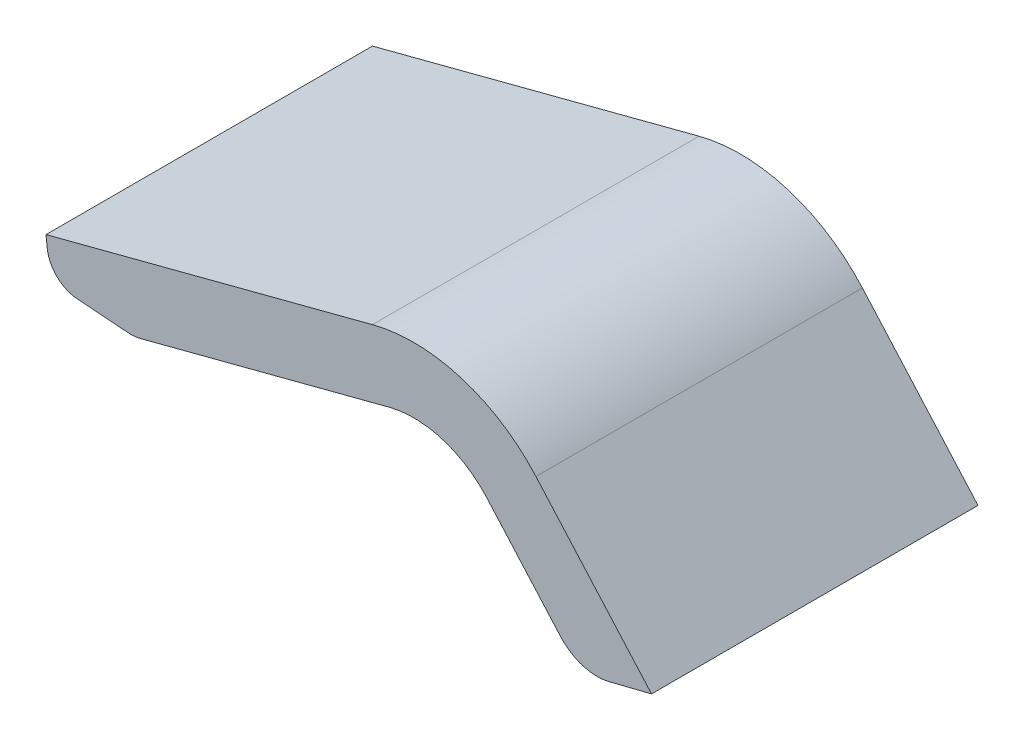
ISO-10303-21;
HEADER;
FILE_DESCRIPTION(('STEP AP214'),'2;1');
FILE_NAME('part.step','',(''),(''),'','','');
FILE_SCHEMA(('AUTOMOTIVE_DESIGN { 1 0 10303 214 1 1 1 1 }'));
ENDSEC;
DATA;
#1=APPLICATION_CONTEXT('core data for automotive mechanical design processes');
#2=APPLICATION_PROTOCOL_DEFINITION('international standard','automotive_design',2000,#1);
#3=PRODUCT_CONTEXT('',#1,'mechanical');
#4=PRODUCT('Part','Part','',(#3));
#5=PRODUCT_RELATED_PRODUCT_CATEGORY('part','',(#4));
#6=PRODUCT_DEFINITION_FORMATION('','',#4);
#7=PRODUCT_DEFINITION_CONTEXT('part definition',#1,'design');
#8=PRODUCT_DEFINITION('design','',#6,#7);
#9=PRODUCT_DEFINITION_SHAPE('','',#8);
#10=(LENGTH_UNIT() NAMED_UNIT(*) SI_UNIT(.MILLI.,.METRE.));
#11=(NAMED_UNIT(*) PLANE_ANGLE_UNIT() SI_UNIT($,.RADIAN.));
#12=(NAMED_UNIT(*) SI_UNIT($,.STERADIAN.) SOLID_ANGLE_UNIT());
#13=UNCERTAINTY_MEASURE_WITH_UNIT(LENGTH_MEASURE(1.E-05),#10,'distance_accuracy_value','');
#14=(GEOMETRIC_REPRESENTATION_CONTEXT(3) GLOBAL_UNCERTAINTY_ASSIGNED_CONTEXT((#13)) GLOBAL_UNIT_ASSIGNED_CONTEXT((#10,
#11,#12)) REPRESENTATION_CONTEXT('',''));
#15=CARTESIAN_POINT('',(0.,0.,0.));
#16=DIRECTION('',(0.,0.,1.));
#17=DIRECTION('',(1.,0.,0.));
#18=AXIS2_PLACEMENT_3D('',#15,#16,#17);
#19=CARTESIAN_POINT('',(-13.3347137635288,0.567654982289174,20.));
#20=DIRECTION('',(0.,0.,-1.));
#21=DIRECTION('',(-1.,0.,0.));
#22=AXIS2_PLACEMENT_3D('',#19,#20,#21);
#23=CYLINDRICAL_SURFACE('',#22,2.);
#24=CARTESIAN_POINT('',(-13.3347137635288,0.567654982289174,0.));
#25=DIRECTION('',(0.,0.,1.));
#26=DIRECTION('',(1.,0.,0.));
#27=AXIS2_PLACEMENT_3D('',#24,#25,#26);
#28=CIRCLE('',#27,2.);
#29=CARTESIAN_POINT('',(-12.8296538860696,-1.36752318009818,0.));
#30=VERTEX_POINT('',#29);
#31=CARTESIAN_POINT('',(-13.4835254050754,-1.42680110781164,0.));
#32=VERTEX_POINT('',#31);
#33=EDGE_CURVE('E143',#30,#32,#28,.F.);
#34=ORIENTED_EDGE('',*,*,#33,.F.);
#35=DIRECTION('',(0.,0.,-1.));
#36=VECTOR('',#35,1.);
#37=CARTESIAN_POINT('',(-12.8296538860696,-1.36752318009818,20.));
#38=LINE('',#37,#36);
#39=CARTESIAN_POINT('',(-12.8296538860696,-1.36752318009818,20.));
#40=VERTEX_POINT('',#39);
#41=EDGE_CURVE('E13',#40,#30,#38,.T.);
#42=ORIENTED_EDGE('',*,*,#41,.F.);
#43=CARTESIAN_POINT('',(-13.3347137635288,0.567654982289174,20.));
#44=DIRECTION('',(0.,0.,1.));
#45=DIRECTION('',(1.,0.,0.));
#46=AXIS2_PLACEMENT_3D('',#43,#44,#45);
#47=CIRCLE('',#46,2.);
#48=CARTESIAN_POINT('',(-13.4835254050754,-1.42680110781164,20.));
#49=VERTEX_POINT('',#48);
#50=EDGE_CURVE('E179',#40,#49,#47,.F.);
#51=ORIENTED_EDGE('',*,*,#50,.T.);
#52=DIRECTION('',(0.,0.,-1.));
#53=VECTOR('',#52,1.);
#54=CARTESIAN_POINT('',(-13.4835254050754,-1.42680110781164,20.));
#55=LINE('',#54,#53);
#56=EDGE_CURVE('E148',#49,#32,#55,.T.);
#57=ORIENTED_EDGE('',*,*,#56,.T.);
#58=EDGE_LOOP('',(#34,#42,#51,#57));
#59=FACE_BOUND('',#58,.T.);
#60=ADVANCED_FACE('F41',(#59),#23,.T.);
#61=CARTESIAN_POINT('',(-6.83704279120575,0.1964813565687,20.));
#62=DIRECTION('',(-0.252529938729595,0.967589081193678,0.));
#63=DIRECTION('',(-0.967589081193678,-0.252529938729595,0.));
#64=AXIS2_PLACEMENT_3D('',#61,#62,#63);
#65=PLANE('',#64);
#66=DIRECTION('',(0.967589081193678,0.252529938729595,0.));
#67=VECTOR('',#66,1.);
#68=CARTESIAN_POINT('',(-6.83704279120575,0.1964813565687,0.));
#69=LINE('',#68,#67);
#70=CARTESIAN_POINT('',(2.43283974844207,2.61581712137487,0.));
#71=VERTEX_POINT('',#70);
#72=EDGE_CURVE('E133',#30,#71,#69,.T.);
#73=ORIENTED_EDGE('',*,*,#72,.T.);
#74=DIRECTION('',(0.,0.,-1.));
#75=VECTOR('',#74,1.);
#76=CARTESIAN_POINT('',(2.43283974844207,2.61581712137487,20.));
#77=LINE('',#76,#75);
#78=CARTESIAN_POINT('',(2.43283974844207,2.61581712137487,20.));
#79=VERTEX_POINT('',#78);
#80=EDGE_CURVE('E48',#79,#71,#77,.T.);
#81=ORIENTED_EDGE('',*,*,#80,.F.);
#82=DIRECTION('',(0.967589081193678,0.252529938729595,0.));
#83=VECTOR('',#82,1.);
#84=CARTESIAN_POINT('',(-6.83704279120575,0.1964813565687,20.));
#85=LINE('',#84,#83);
#86=EDGE_CURVE('E135',#40,#79,#85,.T.);
#87=ORIENTED_EDGE('',*,*,#86,.F.);
#88=ORIENTED_EDGE('',*,*,#41,.T.);
#89=EDGE_LOOP('',(#73,#81,#87,#88));
#90=FACE_BOUND('',#89,.T.);
#91=ADVANCED_FACE('F131',(#90),#65,.F.);
#92=CARTESIAN_POINT('',(3.94801938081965,-3.1897173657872,20.));
#93=DIRECTION('',(0.,0.,-1.));
#94=DIRECTION('',(-1.,0.,0.));
#95=AXIS2_PLACEMENT_3D('',#92,#93,#94);
#96=CYLINDRICAL_SURFACE('',#95,6.00000000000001);
#97=CARTESIAN_POINT('',(3.94801938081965,-3.1897173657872,0.));
#98=DIRECTION('',(0.,0.,1.));
#99=DIRECTION('',(1.,0.,0.));
#100=AXIS2_PLACEMENT_3D('',#97,#98,#99);
#101=CIRCLE('',#100,6.00000000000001);
#102=CARTESIAN_POINT('',(8.44002044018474,0.787961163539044,0.));
#103=VERTEX_POINT('',#102);
#104=EDGE_CURVE('E146',#103,#71,#101,.T.);
#105=ORIENTED_EDGE('',*,*,#104,.F.);
#106=DIRECTION('',(0.,0.,-1.));
#107=VECTOR('',#106,1.);
#108=CARTESIAN_POINT('',(8.44002044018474,0.787961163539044,20.));
#109=LINE('',#108,#107);
#110=CARTESIAN_POINT('',(8.44002044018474,0.787961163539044,20.));
#111=VERTEX_POINT('',#110);
#112=EDGE_CURVE('E222',#111,#103,#109,.T.);
#113=ORIENTED_EDGE('',*,*,#112,.F.);
#114=CARTESIAN_POINT('',(3.94801938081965,-3.1897173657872,20.));
#115=DIRECTION('',(0.,0.,1.));
#116=DIRECTION('',(1.,0.,0.));
#117=AXIS2_PLACEMENT_3D('',#114,#115,#116);
#118=CIRCLE('',#117,6.00000000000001);
#119=EDGE_CURVE('E182',#111,#79,#118,.T.);
#120=ORIENTED_EDGE('',*,*,#119,.T.);
#121=ORIENTED_EDGE('',*,*,#80,.T.);
#122=EDGE_LOOP('',(#105,#113,#120,#121));
#123=FACE_BOUND('',#122,.T.);
#124=ADVANCED_FACE('F224',(#123),#96,.F.);
#125=CARTESIAN_POINT('',(19.7707149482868,-12.0078169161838,20.));
#126=DIRECTION('',(0.748666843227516,0.662946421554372,0.));
#127=DIRECTION('',(-0.662946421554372,0.748666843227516,0.));
#128=AXIS2_PLACEMENT_3D('',#125,#126,#127);
#129=PLANE('',#128);
#130=DIRECTION('',(0.662946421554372,-0.748666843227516,0.));
#131=VECTOR('',#130,1.);
#132=CARTESIAN_POINT('',(19.7707149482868,-12.0078169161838,0.));
#133=LINE('',#132,#131);
#134=CARTESIAN_POINT('',(12.9326564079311,-4.28558245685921,0.));
#135=VERTEX_POINT('',#134);
#136=EDGE_CURVE('E153',#103,#135,#133,.T.);
#137=ORIENTED_EDGE('',*,*,#136,.T.);
#138=DIRECTION('',(0.,0.,-1.));
#139=VECTOR('',#138,1.);
#140=CARTESIAN_POINT('',(12.9326564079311,-4.28558245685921,20.));
#141=LINE('',#140,#139);
#142=CARTESIAN_POINT('',(12.9326564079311,-4.28558245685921,20.));
#143=VERTEX_POINT('',#142);
#144=EDGE_CURVE('E220',#143,#135,#141,.T.);
#145=ORIENTED_EDGE('',*,*,#144,.F.);
#146=DIRECTION('',(0.662946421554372,-0.748666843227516,0.));
#147=VECTOR('',#146,1.);
#148=CARTESIAN_POINT('',(19.7707149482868,-12.0078169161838,20.));
#149=LINE('',#148,#147);
#150=EDGE_CURVE('E185',#111,#143,#149,.T.);
#151=ORIENTED_EDGE('',*,*,#150,.F.);
#152=ORIENTED_EDGE('',*,*,#112,.T.);
#153=EDGE_LOOP('',(#137,#145,#151,#152));
#154=FACE_BOUND('',#153,.T.);
#155=ADVANCED_FACE('F232',(#154),#129,.F.);
#156=CARTESIAN_POINT('',(15.1786569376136,-2.2967431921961,20.));
#157=DIRECTION('',(0.,0.,-1.));
#158=DIRECTION('',(-1.,0.,0.));
#159=AXIS2_PLACEMENT_3D('',#156,#157,#158);
#160=CYLINDRICAL_SURFACE('',#159,3.);
#161=CARTESIAN_POINT('',(15.1786569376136,-2.2967431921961,0.));
#162=DIRECTION('',(0.,0.,1.));
#163=DIRECTION('',(1.,0.,0.));
#164=AXIS2_PLACEMENT_3D('',#161,#162,#163);
#165=CIRCLE('',#164,3.);
#166=CARTESIAN_POINT('',(15.9036492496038,-5.20782308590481,0.));
#167=VERTEX_POINT('',#166);
#168=EDGE_CURVE('E156',#167,#135,#165,.F.);
#169=ORIENTED_EDGE('',*,*,#168,.F.);
#170=DIRECTION('',(0.,0.,-1.));
#171=VECTOR('',#170,1.);
#172=CARTESIAN_POINT('',(15.9036492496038,-5.20782308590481,20.));
#173=LINE('',#172,#171);
#174=CARTESIAN_POINT('',(15.9036492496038,-5.20782308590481,20.));
#175=VERTEX_POINT('',#174);
#176=EDGE_CURVE('E218',#175,#167,#173,.T.);
#177=ORIENTED_EDGE('',*,*,#176,.F.);
#178=CARTESIAN_POINT('',(15.1786569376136,-2.2967431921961,20.));
#179=DIRECTION('',(0.,0.,1.));
#180=DIRECTION('',(1.,0.,0.));
#181=AXIS2_PLACEMENT_3D('',#178,#179,#180);
#182=CIRCLE('',#181,3.);
#183=EDGE_CURVE('E187',#175,#143,#182,.F.);
#184=ORIENTED_EDGE('',*,*,#183,.T.);
#185=ORIENTED_EDGE('',*,*,#144,.T.);
#186=EDGE_LOOP('',(#169,#177,#184,#185));
#187=FACE_BOUND('',#186,.T.);
#188=ADVANCED_FACE('F235',(#187),#160,.T.);
#189=CARTESIAN_POINT('',(-3.91493636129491,-10.1435592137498,20.));
#190=DIRECTION('',(0.241664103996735,-0.970359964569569,0.));
#191=DIRECTION('',(0.970359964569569,0.241664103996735,0.));
#192=AXIS2_PLACEMENT_3D('',#189,#190,#191);
#193=PLANE('',#192);
#194=DIRECTION('',(-0.970359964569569,-0.241664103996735,0.));
#195=VECTOR('',#194,1.);
#196=CARTESIAN_POINT('',(-3.91493636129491,-10.1435592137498,0.));
#197=LINE('',#196,#195);
#198=CARTESIAN_POINT('',(18.5160243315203,-4.55722196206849,0.));
#199=VERTEX_POINT('',#198);
#200=EDGE_CURVE('E159',#199,#167,#197,.T.);
#201=ORIENTED_EDGE('',*,*,#200,.F.);
#202=DIRECTION('',(0.,0.,-1.));
#203=VECTOR('',#202,1.);
#204=CARTESIAN_POINT('',(18.5160243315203,-4.55722196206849,20.));
#205=LINE('',#204,#203);
#206=CARTESIAN_POINT('',(18.5160243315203,-4.55722196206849,20.));
#207=VERTEX_POINT('',#206);
#208=EDGE_CURVE('E216',#207,#199,#205,.T.);
#209=ORIENTED_EDGE('',*,*,#208,.F.);
#210=DIRECTION('',(-0.970359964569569,-0.241664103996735,0.));
#211=VECTOR('',#210,1.);
#212=CARTESIAN_POINT('',(-3.91493636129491,-10.1435592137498,20.));
#213=LINE('',#212,#211);
#214=EDGE_CURVE('E190',#207,#175,#213,.T.);
#215=ORIENTED_EDGE('',*,*,#214,.T.);
#216=ORIENTED_EDGE('',*,*,#176,.T.);
#217=EDGE_LOOP('',(#201,#209,#215,#216));
#218=FACE_BOUND('',#217,.T.);
#219=ADVANCED_FACE('F238',(#218),#193,.T.);
#220=CARTESIAN_POINT('',(22.7653823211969,-9.35603122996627,20.));
#221=DIRECTION('',(0.748666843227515,0.662946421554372,0.));
#222=DIRECTION('',(-0.662946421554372,0.748666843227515,0.));
#223=AXIS2_PLACEMENT_3D('',#220,#221,#222);
#224=PLANE('',#223);
#225=DIRECTION('',(0.662946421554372,-0.748666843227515,0.));
#226=VECTOR('',#225,1.);
#227=CARTESIAN_POINT('',(22.7653823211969,-9.35603122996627,0.));
#228=LINE('',#227,#226);
#229=CARTESIAN_POINT('',(11.4346878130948,3.43974684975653,0.));
#230=VERTEX_POINT('',#229);
#231=EDGE_CURVE('E162',#230,#199,#228,.T.);
#232=ORIENTED_EDGE('',*,*,#231,.F.);
#233=DIRECTION('',(0.,0.,-1.));
#234=VECTOR('',#233,1.);
#235=CARTESIAN_POINT('',(11.4346878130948,3.43974684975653,20.));
#236=LINE('',#235,#234);
#237=CARTESIAN_POINT('',(11.4346878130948,3.43974684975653,20.));
#238=VERTEX_POINT('',#237);
#239=EDGE_CURVE('E214',#238,#230,#236,.T.);
#240=ORIENTED_EDGE('',*,*,#239,.F.);
#241=DIRECTION('',(0.662946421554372,-0.748666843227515,0.));
#242=VECTOR('',#241,1.);
#243=CARTESIAN_POINT('',(22.7653823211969,-9.35603122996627,20.));
#244=LINE('',#243,#242);
#245=EDGE_CURVE('E193',#238,#207,#244,.T.);
#246=ORIENTED_EDGE('',*,*,#245,.T.);
#247=ORIENTED_EDGE('',*,*,#208,.T.);
#248=EDGE_LOOP('',(#232,#240,#246,#247));
#249=FACE_BOUND('',#248,.T.);
#250=ADVANCED_FACE('F242',(#249),#224,.T.);
#251=CARTESIAN_POINT('',(3.94801938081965,-3.1897173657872,20.));
#252=DIRECTION('',(0.,0.,-1.));
#253=DIRECTION('',(-1.,0.,0.));
#254=AXIS2_PLACEMENT_3D('',#251,#252,#253);
#255=CYLINDRICAL_SURFACE('',#254,10.);
#256=CARTESIAN_POINT('',(3.94801938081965,-3.1897173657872,0.));
#257=DIRECTION('',(0.,0.,1.));
#258=DIRECTION('',(1.,0.,0.));
#259=AXIS2_PLACEMENT_3D('',#256,#257,#258);
#260=CIRCLE('',#259,10.);
#261=CARTESIAN_POINT('',(1.42271999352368,6.48617344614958,0.));
#262=VERTEX_POINT('',#261);
#263=EDGE_CURVE('E165',#230,#262,#260,.T.);
#264=ORIENTED_EDGE('',*,*,#263,.T.);
#265=DIRECTION('',(0.,0.,-1.));
#266=VECTOR('',#265,1.);
#267=CARTESIAN_POINT('',(1.42271999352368,6.48617344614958,20.));
#268=LINE('',#267,#266);
#269=CARTESIAN_POINT('',(1.42271999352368,6.48617344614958,20.));
#270=VERTEX_POINT('',#269);
#271=EDGE_CURVE('E212',#270,#262,#268,.T.);
#272=ORIENTED_EDGE('',*,*,#271,.F.);
#273=CARTESIAN_POINT('',(3.94801938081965,-3.1897173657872,20.));
#274=DIRECTION('',(0.,0.,1.));
#275=DIRECTION('',(1.,0.,0.));
#276=AXIS2_PLACEMENT_3D('',#273,#274,#275);
#277=CIRCLE('',#276,10.);
#278=EDGE_CURVE('E196',#238,#270,#277,.T.);
#279=ORIENTED_EDGE('',*,*,#278,.F.);
#280=ORIENTED_EDGE('',*,*,#239,.T.);
#281=EDGE_LOOP('',(#264,#272,#279,#280));
#282=FACE_BOUND('',#281,.T.);
#283=ADVANCED_FACE('F247',(#282),#255,.T.);
#284=CARTESIAN_POINT('',(-7.84716254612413,4.06683768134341,20.));
#285=DIRECTION('',(-0.252529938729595,0.967589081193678,0.));
#286=DIRECTION('',(-0.967589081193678,-0.252529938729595,0.));
#287=AXIS2_PLACEMENT_3D('',#284,#285,#286);
#288=PLANE('',#287);
#289=DIRECTION('',(0.967589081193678,0.252529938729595,0.));
#290=VECTOR('',#289,1.);
#291=CARTESIAN_POINT('',(-7.84716254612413,4.06683768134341,0.));
#292=LINE('',#291,#290);
#293=CARTESIAN_POINT('',(-18.5772800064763,1.26639691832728,0.));
#294=VERTEX_POINT('',#293);
#295=EDGE_CURVE('E168',#294,#262,#292,.T.);
#296=ORIENTED_EDGE('',*,*,#295,.F.);
#297=DIRECTION('',(0.,0.,-1.));
#298=VECTOR('',#297,1.);
#299=CARTESIAN_POINT('',(-18.5772800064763,1.26639691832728,20.));
#300=LINE('',#299,#298);
#301=CARTESIAN_POINT('',(-18.5772800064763,1.26639691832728,20.));
#302=VERTEX_POINT('',#301);
#303=EDGE_CURVE('E210',#302,#294,#300,.T.);
#304=ORIENTED_EDGE('',*,*,#303,.F.);
#305=DIRECTION('',(0.967589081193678,0.252529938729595,0.));
#306=VECTOR('',#305,1.);
#307=CARTESIAN_POINT('',(-7.84716254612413,4.06683768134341,20.));
#308=LINE('',#307,#306);
#309=EDGE_CURVE('E198',#302,#270,#308,.T.);
#310=ORIENTED_EDGE('',*,*,#309,.T.);
#311=ORIENTED_EDGE('',*,*,#271,.T.);
#312=EDGE_LOOP('',(#296,#304,#310,#311));
#313=FACE_BOUND('',#312,.T.);
#314=ADVANCED_FACE('F253',(#313),#288,.T.);
#315=CARTESIAN_POINT('',(-15.06698153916,-30.597029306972,20.));
#316=DIRECTION('',(0.993986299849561,0.109504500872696,0.));
#317=DIRECTION('',(-0.109504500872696,0.993986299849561,0.));
#318=AXIS2_PLACEMENT_3D('',#315,#316,#317);
#319=PLANE('',#318);
#320=DIRECTION('',(0.109504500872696,-0.993986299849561,0.));
#321=VECTOR('',#320,1.);
#322=CARTESIAN_POINT('',(-15.06698153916,-30.597029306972,0.));
#323=LINE('',#322,#321);
#324=CARTESIAN_POINT('',(-18.5023101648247,0.58588611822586,0.));
#325=VERTEX_POINT('',#324);
#326=EDGE_CURVE('E171',#294,#325,#323,.T.);
#327=ORIENTED_EDGE('',*,*,#326,.T.);
#328=DIRECTION('',(0.,0.,-1.));
#329=VECTOR('',#328,1.);
#330=CARTESIAN_POINT('',(-18.5023101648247,0.58588611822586,20.));
#331=LINE('',#330,#329);
#332=CARTESIAN_POINT('',(-18.5023101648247,0.58588611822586,20.));
#333=VERTEX_POINT('',#332);
#334=EDGE_CURVE('E208',#333,#325,#331,.T.);
#335=ORIENTED_EDGE('',*,*,#334,.F.);
#336=DIRECTION('',(0.109504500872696,-0.993986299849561,0.));
#337=VECTOR('',#336,1.);
#338=CARTESIAN_POINT('',(-15.06698153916,-30.597029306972,20.));
#339=LINE('',#338,#337);
#340=EDGE_CURVE('E201',#302,#333,#339,.T.);
#341=ORIENTED_EDGE('',*,*,#340,.F.);
#342=ORIENTED_EDGE('',*,*,#303,.T.);
#343=EDGE_LOOP('',(#327,#335,#341,#342));
#344=FACE_BOUND('',#343,.T.);
#345=ADVANCED_FACE('F256',(#344),#319,.F.);
#346=CARTESIAN_POINT('',(-16.5143375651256,0.804895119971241,20.));
#347=DIRECTION('',(0.,0.,-1.));
#348=DIRECTION('',(-1.,0.,0.));
#349=AXIS2_PLACEMENT_3D('',#346,#347,#348);
#350=CYLINDRICAL_SURFACE('',#349,2.);
#351=CARTESIAN_POINT('',(-16.5143375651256,0.804895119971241,0.));
#352=DIRECTION('',(0.,0.,1.));
#353=DIRECTION('',(1.,0.,0.));
#354=AXIS2_PLACEMENT_3D('',#351,#352,#353);
#355=CIRCLE('',#354,2.);
#356=CARTESIAN_POINT('',(-16.6631492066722,-1.18956097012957,0.));
#357=VERTEX_POINT('',#356);
#358=EDGE_CURVE('E174',#357,#325,#355,.F.);
#359=ORIENTED_EDGE('',*,*,#358,.F.);
#360=DIRECTION('',(0.,0.,-1.));
#361=VECTOR('',#360,1.);
#362=CARTESIAN_POINT('',(-16.6631492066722,-1.18956097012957,20.));
#363=LINE('',#362,#361);
#364=CARTESIAN_POINT('',(-16.6631492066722,-1.18956097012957,20.));
#365=VERTEX_POINT('',#364);
#366=EDGE_CURVE('E63',#365,#357,#363,.T.);
#367=ORIENTED_EDGE('',*,*,#366,.F.);
#368=CARTESIAN_POINT('',(-16.5143375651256,0.804895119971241,20.));
#369=DIRECTION('',(0.,0.,1.));
#370=DIRECTION('',(1.,0.,0.));
#371=AXIS2_PLACEMENT_3D('',#368,#369,#370);
#372=CIRCLE('',#371,2.);
#373=EDGE_CURVE('E203',#365,#333,#372,.F.);
#374=ORIENTED_EDGE('',*,*,#373,.T.);
#375=ORIENTED_EDGE('',*,*,#334,.T.);
#376=EDGE_LOOP('',(#359,#367,#374,#375));
#377=FACE_BOUND('',#376,.T.);
#378=ADVANCED_FACE('F257',(#377),#350,.T.);
#379=CARTESIAN_POINT('',(2.70147752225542,-2.63440696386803,20.));
#380=DIRECTION('',(0.0744058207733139,0.997228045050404,0.));
#381=DIRECTION('',(-0.997228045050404,0.0744058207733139,0.));
#382=AXIS2_PLACEMENT_3D('',#379,#380,#381);
#383=PLANE('',#382);
#384=DIRECTION('',(0.997228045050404,-0.0744058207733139,0.));
#385=VECTOR('',#384,1.);
#386=CARTESIAN_POINT('',(2.70147752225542,-2.63440696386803,0.));
#387=LINE('',#386,#385);
#388=EDGE_CURVE('E177',#357,#32,#387,.T.);
#389=ORIENTED_EDGE('',*,*,#388,.T.);
#390=ORIENTED_EDGE('',*,*,#56,.F.);
#391=DIRECTION('',(0.997228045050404,-0.0744058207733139,0.));
#392=VECTOR('',#391,1.);
#393=CARTESIAN_POINT('',(2.70147752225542,-2.63440696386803,20.));
#394=LINE('',#393,#392);
#395=EDGE_CURVE('E55',#365,#49,#394,.T.);
#396=ORIENTED_EDGE('',*,*,#395,.F.);
#397=ORIENTED_EDGE('',*,*,#366,.T.);
#398=EDGE_LOOP('',(#389,#390,#396,#397));
#399=FACE_BOUND('',#398,.T.);
#400=ADVANCED_FACE('F259',(#399),#383,.F.);
#401=CARTESIAN_POINT('',(0.745085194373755,-28.8550611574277,20.));
#402=DIRECTION('',(0.,0.,1.));
#403=DIRECTION('',(1.,0.,0.));
#404=AXIS2_PLACEMENT_3D('',#401,#402,#403);
#405=PLANE('',#404);
#406=ORIENTED_EDGE('',*,*,#50,.F.);
#407=ORIENTED_EDGE('',*,*,#86,.T.);
#408=ORIENTED_EDGE('',*,*,#119,.F.);
#409=ORIENTED_EDGE('',*,*,#150,.T.);
#410=ORIENTED_EDGE('',*,*,#183,.F.);
#411=ORIENTED_EDGE('',*,*,#214,.F.);
#412=ORIENTED_EDGE('',*,*,#245,.F.);
#413=ORIENTED_EDGE('',*,*,#278,.T.);
#414=ORIENTED_EDGE('',*,*,#309,.F.);
#415=ORIENTED_EDGE('',*,*,#340,.T.);
#416=ORIENTED_EDGE('',*,*,#373,.F.);
#417=ORIENTED_EDGE('',*,*,#395,.T.);
#418=EDGE_LOOP('',(#406,#407,#408,#409,#410,#411,#412,#413,#414,#415,#416,#417));
#419=FACE_BOUND('',#418,.T.);
#420=ADVANCED_FACE('F227',(#419),#405,.T.);
#421=CARTESIAN_POINT('',(0.745085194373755,-28.8550611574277,0.));
#422=DIRECTION('',(0.,0.,1.));
#423=DIRECTION('',(1.,0.,0.));
#424=AXIS2_PLACEMENT_3D('',#421,#422,#423);
#425=PLANE('',#424);
#426=ORIENTED_EDGE('',*,*,#33,.T.);
#427=ORIENTED_EDGE('',*,*,#388,.F.);
#428=ORIENTED_EDGE('',*,*,#358,.T.);
#429=ORIENTED_EDGE('',*,*,#326,.F.);
#430=ORIENTED_EDGE('',*,*,#295,.T.);
#431=ORIENTED_EDGE('',*,*,#263,.F.);
#432=ORIENTED_EDGE('',*,*,#231,.T.);
#433=ORIENTED_EDGE('',*,*,#200,.T.);
#434=ORIENTED_EDGE('',*,*,#168,.T.);
#435=ORIENTED_EDGE('',*,*,#136,.F.);
#436=ORIENTED_EDGE('',*,*,#104,.T.);
#437=ORIENTED_EDGE('',*,*,#72,.F.);
#438=EDGE_LOOP('',(#426,#427,#428,#429,#430,#431,#432,#433,#434,#435,#436,#437));
#439=FACE_BOUND('',#438,.T.);
#440=ADVANCED_FACE('F141',(#439),#425,.F.);
#441=CLOSED_SHELL('',(#60,#91,#124,#155,#188,#219,#250,#283,#314,#345,#378,#400,#420,#440));
#442=MANIFOLD_SOLID_BREP('B2',#441);
#443=ADVANCED_BREP_SHAPE_REPRESENTATION('',(#18,#442),#14);
#444=SHAPE_DEFINITION_REPRESENTATION(#9,#443);
ENDSEC;
END-ISO-10303-21;
